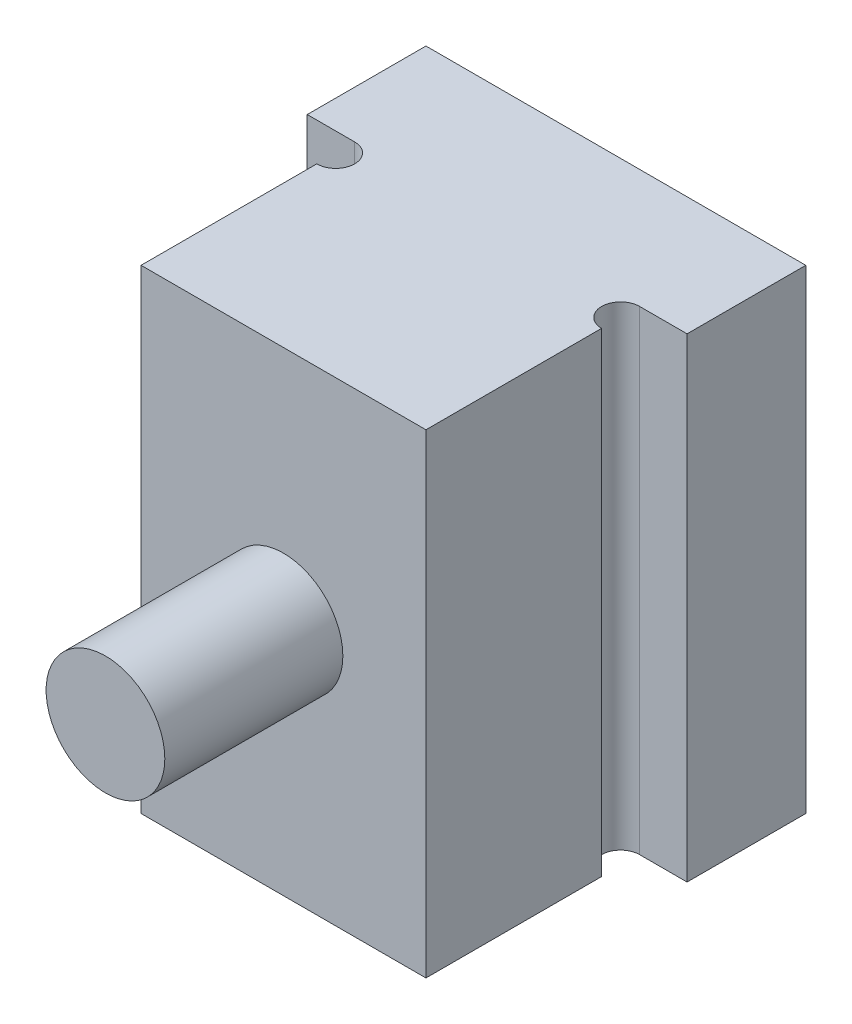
ISO-10303-21;
HEADER;
FILE_DESCRIPTION(('STEP AP214'),'2;1');
FILE_NAME('part.step','',(''),(''),'','','');
FILE_SCHEMA(('AUTOMOTIVE_DESIGN { 1 0 10303 214 1 1 1 1 }'));
ENDSEC;
DATA;
#1=APPLICATION_CONTEXT('core data for automotive mechanical design processes');
#2=APPLICATION_PROTOCOL_DEFINITION('international standard','automotive_design',2000,#1);
#3=PRODUCT_CONTEXT('',#1,'mechanical');
#4=PRODUCT('Part','Part','',(#3));
#5=PRODUCT_RELATED_PRODUCT_CATEGORY('part','',(#4));
#6=PRODUCT_DEFINITION_FORMATION('','',#4);
#7=PRODUCT_DEFINITION_CONTEXT('part definition',#1,'design');
#8=PRODUCT_DEFINITION('design','',#6,#7);
#9=PRODUCT_DEFINITION_SHAPE('','',#8);
#10=(LENGTH_UNIT() NAMED_UNIT(*) SI_UNIT(.MILLI.,.METRE.));
#11=(NAMED_UNIT(*) PLANE_ANGLE_UNIT() SI_UNIT($,.RADIAN.));
#12=(NAMED_UNIT(*) SI_UNIT($,.STERADIAN.) SOLID_ANGLE_UNIT());
#13=UNCERTAINTY_MEASURE_WITH_UNIT(LENGTH_MEASURE(1.E-05),#10,'distance_accuracy_value','');
#14=(GEOMETRIC_REPRESENTATION_CONTEXT(3) GLOBAL_UNCERTAINTY_ASSIGNED_CONTEXT((#13)) GLOBAL_UNIT_ASSIGNED_CONTEXT((#10,
#11,#12)) REPRESENTATION_CONTEXT('',''));
#15=CARTESIAN_POINT('',(0.,0.,0.));
#16=DIRECTION('',(0.,0.,1.));
#17=DIRECTION('',(1.,0.,0.));
#18=AXIS2_PLACEMENT_3D('',#15,#16,#17);
#19=CARTESIAN_POINT('',(-1.15470053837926,2.,-9.95));
#20=DIRECTION('',(0.,0.,1.));
#21=DIRECTION('',(-1.,0.,0.));
#22=AXIS2_PLACEMENT_3D('',#19,#20,#21);
#23=PLANE('',#22);
#24=DIRECTION('',(1.,0.,0.));
#25=VECTOR('',#24,1.);
#26=CARTESIAN_POINT('',(-1.15470053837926,2.,-9.95));
#27=LINE('',#26,#25);
#28=CARTESIAN_POINT('',(-1.15470053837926,2.,-9.95));
#29=VERTEX_POINT('',#28);
#30=CARTESIAN_POINT('',(1.15470053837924,2.,-9.95));
#31=VERTEX_POINT('',#30);
#32=EDGE_CURVE('E128',#29,#31,#27,.T.);
#33=ORIENTED_EDGE('',*,*,#32,.T.);
#34=DIRECTION('',(0.5,-0.866025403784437,0.));
#35=VECTOR('',#34,1.);
#36=CARTESIAN_POINT('',(1.15470053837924,2.,-9.95));
#37=LINE('',#36,#35);
#38=CARTESIAN_POINT('',(2.3094010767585,0.,-9.95));
#39=VERTEX_POINT('',#38);
#40=EDGE_CURVE('E133',#31,#39,#37,.T.);
#41=ORIENTED_EDGE('',*,*,#40,.T.);
#42=DIRECTION('',(0.5,0.866025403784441,0.));
#43=VECTOR('',#42,1.);
#44=CARTESIAN_POINT('',(1.15470053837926,-2.,-9.95));
#45=LINE('',#44,#43);
#46=CARTESIAN_POINT('',(1.15470053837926,-2.,-9.95));
#47=VERTEX_POINT('',#46);
#48=EDGE_CURVE('E184',#47,#39,#45,.T.);
#49=ORIENTED_EDGE('',*,*,#48,.F.);
#50=DIRECTION('',(1.,0.,0.));
#51=VECTOR('',#50,1.);
#52=CARTESIAN_POINT('',(-1.15470053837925,-2.,-9.95));
#53=LINE('',#52,#51);
#54=CARTESIAN_POINT('',(-1.15470053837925,-2.,-9.95));
#55=VERTEX_POINT('',#54);
#56=EDGE_CURVE('E149',#55,#47,#53,.T.);
#57=ORIENTED_EDGE('',*,*,#56,.F.);
#58=DIRECTION('',(-0.5,0.866025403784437,0.));
#59=VECTOR('',#58,1.);
#60=CARTESIAN_POINT('',(-1.15470053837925,-2.,-9.95));
#61=LINE('',#60,#59);
#62=CARTESIAN_POINT('',(-2.30940107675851,0.,-9.95));
#63=VERTEX_POINT('',#62);
#64=EDGE_CURVE('E144',#55,#63,#61,.T.);
#65=ORIENTED_EDGE('',*,*,#64,.T.);
#66=DIRECTION('',(-0.5,-0.866025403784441,0.));
#67=VECTOR('',#66,1.);
#68=CARTESIAN_POINT('',(-1.15470053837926,2.,-9.95));
#69=LINE('',#68,#67);
#70=EDGE_CURVE('E146',#29,#63,#69,.T.);
#71=ORIENTED_EDGE('',*,*,#70,.F.);
#72=EDGE_LOOP('',(#33,#41,#49,#57,#65,#71));
#73=FACE_BOUND('',#72,.T.);
#74=ADVANCED_FACE('F16',(#73),#23,.F.);
#75=CARTESIAN_POINT('',(-1.15470053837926,2.,-9.95));
#76=DIRECTION('',(0.866025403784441,-0.5,0.));
#77=DIRECTION('',(-0.5,-0.866025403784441,0.));
#78=AXIS2_PLACEMENT_3D('',#75,#76,#77);
#79=PLANE('',#78);
#80=ORIENTED_EDGE('',*,*,#70,.T.);
#81=DIRECTION('',(0.,0.,-1.));
#82=VECTOR('',#81,1.);
#83=CARTESIAN_POINT('',(-2.30940107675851,0.,-9.95));
#84=LINE('',#83,#82);
#85=CARTESIAN_POINT('',(-2.30940107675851,0.,-13.5));
#86=VERTEX_POINT('',#85);
#87=EDGE_CURVE('E155',#63,#86,#84,.T.);
#88=ORIENTED_EDGE('',*,*,#87,.T.);
#89=DIRECTION('',(0.5,0.866025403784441,0.));
#90=VECTOR('',#89,1.);
#91=CARTESIAN_POINT('',(-2.30940107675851,0.,-13.5));
#92=LINE('',#91,#90);
#93=CARTESIAN_POINT('',(-1.15470053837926,2.,-13.5));
#94=VERTEX_POINT('',#93);
#95=EDGE_CURVE('E200',#86,#94,#92,.T.);
#96=ORIENTED_EDGE('',*,*,#95,.T.);
#97=DIRECTION('',(0.,0.,-1.));
#98=VECTOR('',#97,1.);
#99=CARTESIAN_POINT('',(-1.15470053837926,2.,-9.95));
#100=LINE('',#99,#98);
#101=EDGE_CURVE('E152',#94,#29,#100,.F.);
#102=ORIENTED_EDGE('',*,*,#101,.T.);
#103=EDGE_LOOP('',(#80,#88,#96,#102));
#104=FACE_BOUND('',#103,.T.);
#105=ADVANCED_FACE('F163',(#104),#79,.T.);
#106=CARTESIAN_POINT('',(-1.15470053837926,2.,-9.95));
#107=DIRECTION('',(0.,1.,0.));
#108=DIRECTION('',(1.,0.,0.));
#109=AXIS2_PLACEMENT_3D('',#106,#107,#108);
#110=PLANE('',#109);
#111=DIRECTION('',(0.,0.,-1.));
#112=VECTOR('',#111,1.);
#113=CARTESIAN_POINT('',(1.15470053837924,2.,-9.95));
#114=LINE('',#113,#112);
#115=CARTESIAN_POINT('',(1.15470053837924,2.,-13.5));
#116=VERTEX_POINT('',#115);
#117=EDGE_CURVE('E190',#116,#31,#114,.F.);
#118=ORIENTED_EDGE('',*,*,#117,.T.);
#119=ORIENTED_EDGE('',*,*,#32,.F.);
#120=ORIENTED_EDGE('',*,*,#101,.F.);
#121=DIRECTION('',(-1.,0.,0.));
#122=VECTOR('',#121,1.);
#123=CARTESIAN_POINT('',(0.,2.,-13.5));
#124=LINE('',#123,#122);
#125=EDGE_CURVE('E161',#94,#116,#124,.F.);
#126=ORIENTED_EDGE('',*,*,#125,.T.);
#127=EDGE_LOOP('',(#118,#119,#120,#126));
#128=FACE_BOUND('',#127,.T.);
#129=ADVANCED_FACE('F342',(#128),#110,.F.);
#130=CARTESIAN_POINT('',(1.15470053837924,2.,-9.95));
#131=DIRECTION('',(0.866025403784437,0.5,0.));
#132=DIRECTION('',(0.5,-0.866025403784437,0.));
#133=AXIS2_PLACEMENT_3D('',#130,#131,#132);
#134=PLANE('',#133);
#135=DIRECTION('',(0.,0.,-1.));
#136=VECTOR('',#135,1.);
#137=CARTESIAN_POINT('',(2.3094010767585,0.,-9.95));
#138=LINE('',#137,#136);
#139=CARTESIAN_POINT('',(2.3094010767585,0.,-13.5));
#140=VERTEX_POINT('',#139);
#141=EDGE_CURVE('E180',#39,#140,#138,.T.);
#142=ORIENTED_EDGE('',*,*,#141,.F.);
#143=ORIENTED_EDGE('',*,*,#40,.F.);
#144=ORIENTED_EDGE('',*,*,#117,.F.);
#145=DIRECTION('',(0.5,-0.866025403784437,0.));
#146=VECTOR('',#145,1.);
#147=CARTESIAN_POINT('',(1.15470053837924,2.,-13.5));
#148=LINE('',#147,#146);
#149=EDGE_CURVE('E600',#116,#140,#148,.T.);
#150=ORIENTED_EDGE('',*,*,#149,.T.);
#151=EDGE_LOOP('',(#142,#143,#144,#150));
#152=FACE_BOUND('',#151,.T.);
#153=ADVANCED_FACE('F528',(#152),#134,.F.);
#154=CARTESIAN_POINT('',(1.15470053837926,-2.,-9.95));
#155=DIRECTION('',(-0.866025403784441,0.5,0.));
#156=DIRECTION('',(0.5,0.866025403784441,0.));
#157=AXIS2_PLACEMENT_3D('',#154,#155,#156);
#158=PLANE('',#157);
#159=ORIENTED_EDGE('',*,*,#48,.T.);
#160=ORIENTED_EDGE('',*,*,#141,.T.);
#161=DIRECTION('',(-0.5,-0.866025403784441,0.));
#162=VECTOR('',#161,1.);
#163=CARTESIAN_POINT('',(2.3094010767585,0.,-13.5));
#164=LINE('',#163,#162);
#165=CARTESIAN_POINT('',(1.15470053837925,-2.,-13.5));
#166=VERTEX_POINT('',#165);
#167=EDGE_CURVE('E603',#140,#166,#164,.T.);
#168=ORIENTED_EDGE('',*,*,#167,.T.);
#169=DIRECTION('',(0.,0.,-1.));
#170=VECTOR('',#169,1.);
#171=CARTESIAN_POINT('',(1.15470053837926,-2.,-9.95));
#172=LINE('',#171,#170);
#173=EDGE_CURVE('E174',#47,#166,#172,.T.);
#174=ORIENTED_EDGE('',*,*,#173,.F.);
#175=EDGE_LOOP('',(#159,#160,#168,#174));
#176=FACE_BOUND('',#175,.T.);
#177=ADVANCED_FACE('F519',(#176),#158,.T.);
#178=CARTESIAN_POINT('',(-1.15470053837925,-2.,-9.95));
#179=DIRECTION('',(0.,1.,0.));
#180=DIRECTION('',(1.,0.,0.));
#181=AXIS2_PLACEMENT_3D('',#178,#179,#180);
#182=PLANE('',#181);
#183=ORIENTED_EDGE('',*,*,#56,.T.);
#184=ORIENTED_EDGE('',*,*,#173,.T.);
#185=DIRECTION('',(-1.,0.,0.));
#186=VECTOR('',#185,1.);
#187=CARTESIAN_POINT('',(0.,-2.,-13.5));
#188=LINE('',#187,#186);
#189=CARTESIAN_POINT('',(-1.15470053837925,-2.,-13.5));
#190=VERTEX_POINT('',#189);
#191=EDGE_CURVE('E605',#166,#190,#188,.T.);
#192=ORIENTED_EDGE('',*,*,#191,.T.);
#193=DIRECTION('',(0.,0.,-1.));
#194=VECTOR('',#193,1.);
#195=CARTESIAN_POINT('',(-1.15470053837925,-2.,-9.95));
#196=LINE('',#195,#194);
#197=EDGE_CURVE('E153',#190,#55,#196,.F.);
#198=ORIENTED_EDGE('',*,*,#197,.T.);
#199=EDGE_LOOP('',(#183,#184,#192,#198));
#200=FACE_BOUND('',#199,.T.);
#201=ADVANCED_FACE('F511',(#200),#182,.T.);
#202=CARTESIAN_POINT('',(-1.15470053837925,-2.,-9.95));
#203=DIRECTION('',(-0.866025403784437,-0.5,0.));
#204=DIRECTION('',(-0.5,0.866025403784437,0.));
#205=AXIS2_PLACEMENT_3D('',#202,#203,#204);
#206=PLANE('',#205);
#207=ORIENTED_EDGE('',*,*,#87,.F.);
#208=ORIENTED_EDGE('',*,*,#64,.F.);
#209=ORIENTED_EDGE('',*,*,#197,.F.);
#210=DIRECTION('',(-0.5,0.866025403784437,0.));
#211=VECTOR('',#210,1.);
#212=CARTESIAN_POINT('',(-1.15470053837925,-2.,-13.5));
#213=LINE('',#212,#211);
#214=EDGE_CURVE('E36',#190,#86,#213,.T.);
#215=ORIENTED_EDGE('',*,*,#214,.T.);
#216=EDGE_LOOP('',(#207,#208,#209,#215));
#217=FACE_BOUND('',#216,.T.);
#218=ADVANCED_FACE('F156',(#217),#206,.F.);
#219=CARTESIAN_POINT('',(0.,-4.05,-13.5));
#220=DIRECTION('',(0.,0.,1.));
#221=DIRECTION('',(-1.,0.,0.));
#222=AXIS2_PLACEMENT_3D('',#219,#220,#221);
#223=PLANE('',#222);
#224=CARTESIAN_POINT('',(0.,0.,-13.5));
#225=DIRECTION('',(0.,0.,1.));
#226=DIRECTION('',(-1.,0.,0.));
#227=AXIS2_PLACEMENT_3D('',#224,#225,#226);
#228=CIRCLE('',#227,4.25);
#229=CARTESIAN_POINT('',(-4.25,0.,-13.5));
#230=VERTEX_POINT('',#229);
#231=EDGE_CURVE('E199',#230,#230,#228,.T.);
#232=ORIENTED_EDGE('',*,*,#231,.F.);
#233=EDGE_LOOP('',(#232));
#234=FACE_BOUND('',#233,.T.);
#235=ORIENTED_EDGE('',*,*,#214,.F.);
#236=ORIENTED_EDGE('',*,*,#191,.F.);
#237=ORIENTED_EDGE('',*,*,#167,.F.);
#238=ORIENTED_EDGE('',*,*,#149,.F.);
#239=ORIENTED_EDGE('',*,*,#125,.F.);
#240=ORIENTED_EDGE('',*,*,#95,.F.);
#241=EDGE_LOOP('',(#235,#236,#237,#238,#239,#240));
#242=FACE_BOUND('',#241,.T.);
#243=ADVANCED_FACE('F347',(#234,#242),#223,.F.);
#244=CARTESIAN_POINT('',(0.,0.,-8.5));
#245=DIRECTION('',(0.,0.,-1.));
#246=DIRECTION('',(1.,0.,0.));
#247=AXIS2_PLACEMENT_3D('',#244,#245,#246);
#248=CYLINDRICAL_SURFACE('',#247,4.25);
#249=CARTESIAN_POINT('',(0.,0.,-8.5));
#250=DIRECTION('',(0.,0.,-1.));
#251=DIRECTION('',(1.,0.,0.));
#252=AXIS2_PLACEMENT_3D('',#249,#250,#251);
#253=CIRCLE('',#252,4.25);
#254=CARTESIAN_POINT('',(4.25,0.,-8.5));
#255=VERTEX_POINT('',#254);
#256=EDGE_CURVE('E195',#255,#255,#253,.T.);
#257=ORIENTED_EDGE('',*,*,#256,.T.);
#258=EDGE_LOOP('',(#257));
#259=FACE_BOUND('',#258,.T.);
#260=ORIENTED_EDGE('',*,*,#231,.T.);
#261=EDGE_LOOP('',(#260));
#262=FACE_BOUND('',#261,.T.);
#263=ADVANCED_FACE('F350',(#259,#262),#248,.T.);
#264=CARTESIAN_POINT('',(-6.,9.99999999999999,-8.2));
#265=DIRECTION('',(0.,-1.,0.));
#266=DIRECTION('',(-1.,0.,0.));
#267=AXIS2_PLACEMENT_3D('',#264,#265,#266);
#268=CYLINDRICAL_SURFACE('',#267,0.8);
#269=CARTESIAN_POINT('',(-6.,9.99999999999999,-8.2));
#270=DIRECTION('',(0.,-1.,0.));
#271=DIRECTION('',(-1.,0.,0.));
#272=AXIS2_PLACEMENT_3D('',#269,#270,#271);
#273=CIRCLE('',#272,0.8);
#274=CARTESIAN_POINT('',(-6.,9.99999999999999,-9.));
#275=VERTEX_POINT('',#274);
#276=CARTESIAN_POINT('',(-6.,9.99999999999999,-7.4));
#277=VERTEX_POINT('',#276);
#278=EDGE_CURVE('E275',#275,#277,#273,.T.);
#279=ORIENTED_EDGE('',*,*,#278,.F.);
#280=DIRECTION('',(0.,-1.,0.));
#281=VECTOR('',#280,1.);
#282=CARTESIAN_POINT('',(-6.,9.99999999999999,-9.));
#283=LINE('',#282,#281);
#284=CARTESIAN_POINT('',(-6.,-9.99999999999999,-9.));
#285=VERTEX_POINT('',#284);
#286=EDGE_CURVE('E213',#275,#285,#283,.T.);
#287=ORIENTED_EDGE('',*,*,#286,.T.);
#288=CARTESIAN_POINT('',(-6.,-9.99999999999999,-8.2));
#289=DIRECTION('',(0.,-1.,0.));
#290=DIRECTION('',(-1.,0.,0.));
#291=AXIS2_PLACEMENT_3D('',#288,#289,#290);
#292=CIRCLE('',#291,0.8);
#293=CARTESIAN_POINT('',(-6.,-9.99999999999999,-7.4));
#294=VERTEX_POINT('',#293);
#295=EDGE_CURVE('E279',#294,#285,#292,.F.);
#296=ORIENTED_EDGE('',*,*,#295,.F.);
#297=DIRECTION('',(0.,-1.,0.));
#298=VECTOR('',#297,1.);
#299=CARTESIAN_POINT('',(-6.,-9.99999999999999,-7.4));
#300=LINE('',#299,#298);
#301=EDGE_CURVE('E236',#294,#277,#300,.F.);
#302=ORIENTED_EDGE('',*,*,#301,.T.);
#303=EDGE_LOOP('',(#279,#287,#296,#302));
#304=FACE_BOUND('',#303,.T.);
#305=ADVANCED_FACE('F354',(#304),#268,.F.);
#306=CARTESIAN_POINT('',(-12.,9.99999999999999,-9.));
#307=DIRECTION('',(0.,0.,-1.));
#308=DIRECTION('',(1.,0.,0.));
#309=AXIS2_PLACEMENT_3D('',#306,#307,#308);
#310=PLANE('',#309);
#311=DIRECTION('',(0.,-1.,0.));
#312=VECTOR('',#311,1.);
#313=CARTESIAN_POINT('',(-8.,-9.99999999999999,-9.));
#314=LINE('',#313,#312);
#315=CARTESIAN_POINT('',(-8.,9.99999999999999,-9.));
#316=VERTEX_POINT('',#315);
#317=CARTESIAN_POINT('',(-8.,-9.99999999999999,-9.));
#318=VERTEX_POINT('',#317);
#319=EDGE_CURVE('E211',#316,#318,#314,.T.);
#320=ORIENTED_EDGE('',*,*,#319,.T.);
#321=DIRECTION('',(1.,0.,0.));
#322=VECTOR('',#321,1.);
#323=CARTESIAN_POINT('',(-12.,-9.99999999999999,-9.));
#324=LINE('',#323,#322);
#325=EDGE_CURVE('E217',#285,#318,#324,.F.);
#326=ORIENTED_EDGE('',*,*,#325,.F.);
#327=ORIENTED_EDGE('',*,*,#286,.F.);
#328=DIRECTION('',(1.,0.,0.));
#329=VECTOR('',#328,1.);
#330=CARTESIAN_POINT('',(6.,9.99999999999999,-9.));
#331=LINE('',#330,#329);
#332=EDGE_CURVE('E207',#316,#275,#331,.T.);
#333=ORIENTED_EDGE('',*,*,#332,.F.);
#334=EDGE_LOOP('',(#320,#326,#327,#333));
#335=FACE_BOUND('',#334,.T.);
#336=ADVANCED_FACE('F365',(#335),#310,.F.);
#337=CARTESIAN_POINT('',(-8.,-9.99999999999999,-14.));
#338=DIRECTION('',(1.,0.,0.));
#339=DIRECTION('',(0.,-1.,0.));
#340=AXIS2_PLACEMENT_3D('',#337,#338,#339);
#341=PLANE('',#340);
#342=DIRECTION('',(0.,1.,0.));
#343=VECTOR('',#342,1.);
#344=CARTESIAN_POINT('',(-8.,-9.99999999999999,-14.));
#345=LINE('',#344,#343);
#346=CARTESIAN_POINT('',(-8.,-9.99999999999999,-14.));
#347=VERTEX_POINT('',#346);
#348=CARTESIAN_POINT('',(-8.,9.99999999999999,-14.));
#349=VERTEX_POINT('',#348);
#350=EDGE_CURVE('E302',#347,#349,#345,.T.);
#351=ORIENTED_EDGE('',*,*,#350,.F.);
#352=DIRECTION('',(0.,0.,1.));
#353=VECTOR('',#352,1.);
#354=CARTESIAN_POINT('',(-8.,-9.99999999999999,-14.));
#355=LINE('',#354,#353);
#356=EDGE_CURVE('E242',#318,#347,#355,.F.);
#357=ORIENTED_EDGE('',*,*,#356,.F.);
#358=ORIENTED_EDGE('',*,*,#319,.F.);
#359=DIRECTION('',(0.,0.,-1.));
#360=VECTOR('',#359,1.);
#361=CARTESIAN_POINT('',(-8.,9.99999999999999,-14.));
#362=LINE('',#361,#360);
#363=EDGE_CURVE('E259',#316,#349,#362,.T.);
#364=ORIENTED_EDGE('',*,*,#363,.T.);
#365=EDGE_LOOP('',(#351,#357,#358,#364));
#366=FACE_BOUND('',#365,.T.);
#367=ADVANCED_FACE('F333',(#366),#341,.F.);
#368=CARTESIAN_POINT('',(8.,-9.99999999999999,-14.));
#369=DIRECTION('',(0.,0.,1.));
#370=DIRECTION('',(-1.,0.,0.));
#371=AXIS2_PLACEMENT_3D('',#368,#369,#370);
#372=PLANE('',#371);
#373=DIRECTION('',(-1.,0.,0.));
#374=VECTOR('',#373,1.);
#375=CARTESIAN_POINT('',(8.,-9.99999999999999,-14.));
#376=LINE('',#375,#374);
#377=CARTESIAN_POINT('',(8.,-9.99999999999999,-14.));
#378=VERTEX_POINT('',#377);
#379=EDGE_CURVE('E298',#378,#347,#376,.T.);
#380=ORIENTED_EDGE('',*,*,#379,.T.);
#381=ORIENTED_EDGE('',*,*,#350,.T.);
#382=DIRECTION('',(-1.,0.,0.));
#383=VECTOR('',#382,1.);
#384=CARTESIAN_POINT('',(8.,9.99999999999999,-14.));
#385=LINE('',#384,#383);
#386=CARTESIAN_POINT('',(8.,9.99999999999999,-14.));
#387=VERTEX_POINT('',#386);
#388=EDGE_CURVE('E267',#387,#349,#385,.T.);
#389=ORIENTED_EDGE('',*,*,#388,.F.);
#390=DIRECTION('',(0.,-1.,0.));
#391=VECTOR('',#390,1.);
#392=CARTESIAN_POINT('',(8.,-9.99999999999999,-14.));
#393=LINE('',#392,#391);
#394=EDGE_CURVE('E294',#387,#378,#393,.T.);
#395=ORIENTED_EDGE('',*,*,#394,.T.);
#396=EDGE_LOOP('',(#380,#381,#389,#395));
#397=FACE_BOUND('',#396,.T.);
#398=CARTESIAN_POINT('',(0.,0.,-14.));
#399=DIRECTION('',(0.,0.,1.));
#400=DIRECTION('',(-1.,0.,0.));
#401=AXIS2_PLACEMENT_3D('',#398,#399,#400);
#402=CIRCLE('',#401,5.);
#403=CARTESIAN_POINT('',(-5.,0.,-14.));
#404=VERTEX_POINT('',#403);
#405=EDGE_CURVE('E20',#404,#404,#402,.T.);
#406=ORIENTED_EDGE('',*,*,#405,.T.);
#407=EDGE_LOOP('',(#406));
#408=FACE_BOUND('',#407,.T.);
#409=ADVANCED_FACE('F320',(#397,#408),#372,.F.);
#410=CARTESIAN_POINT('',(0.,0.,-14.));
#411=DIRECTION('',(0.,0.,-1.));
#412=DIRECTION('',(1.,0.,0.));
#413=AXIS2_PLACEMENT_3D('',#410,#411,#412);
#414=CYLINDRICAL_SURFACE('',#413,5.);
#415=CARTESIAN_POINT('',(0.,0.,-8.5));
#416=DIRECTION('',(0.,0.,-1.));
#417=DIRECTION('',(1.,0.,0.));
#418=AXIS2_PLACEMENT_3D('',#415,#416,#417);
#419=CIRCLE('',#418,5.);
#420=CARTESIAN_POINT('',(5.,0.,-8.5));
#421=VERTEX_POINT('',#420);
#422=EDGE_CURVE('E225',#421,#421,#419,.T.);
#423=ORIENTED_EDGE('',*,*,#422,.F.);
#424=EDGE_LOOP('',(#423));
#425=FACE_BOUND('',#424,.T.);
#426=ORIENTED_EDGE('',*,*,#405,.F.);
#427=EDGE_LOOP('',(#426));
#428=FACE_BOUND('',#427,.T.);
#429=ADVANCED_FACE('F18',(#425,#428),#414,.F.);
#430=CARTESIAN_POINT('',(0.,-5.,-8.5));
#431=DIRECTION('',(0.,0.,1.));
#432=DIRECTION('',(-1.,0.,0.));
#433=AXIS2_PLACEMENT_3D('',#430,#431,#432);
#434=PLANE('',#433);
#435=ORIENTED_EDGE('',*,*,#256,.F.);
#436=EDGE_LOOP('',(#435));
#437=FACE_BOUND('',#436,.T.);
#438=ORIENTED_EDGE('',*,*,#422,.T.);
#439=EDGE_LOOP('',(#438));
#440=FACE_BOUND('',#439,.T.);
#441=ADVANCED_FACE('F323',(#437,#440),#434,.F.);
#442=CARTESIAN_POINT('',(8.,-9.99999999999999,-14.));
#443=DIRECTION('',(-1.,0.,0.));
#444=DIRECTION('',(0.,1.,0.));
#445=AXIS2_PLACEMENT_3D('',#442,#443,#444);
#446=PLANE('',#445);
#447=ORIENTED_EDGE('',*,*,#394,.F.);
#448=DIRECTION('',(0.,0.,-1.));
#449=VECTOR('',#448,1.);
#450=CARTESIAN_POINT('',(8.,9.99999999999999,-14.));
#451=LINE('',#450,#449);
#452=CARTESIAN_POINT('',(8.,9.99999999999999,-9.));
#453=VERTEX_POINT('',#452);
#454=EDGE_CURVE('E249',#453,#387,#451,.T.);
#455=ORIENTED_EDGE('',*,*,#454,.F.);
#456=DIRECTION('',(0.,1.,0.));
#457=VECTOR('',#456,1.);
#458=CARTESIAN_POINT('',(8.,-9.99999999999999,-9.));
#459=LINE('',#458,#457);
#460=CARTESIAN_POINT('',(8.,-9.99999999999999,-9.));
#461=VERTEX_POINT('',#460);
#462=EDGE_CURVE('E212',#461,#453,#459,.T.);
#463=ORIENTED_EDGE('',*,*,#462,.F.);
#464=DIRECTION('',(0.,0.,1.));
#465=VECTOR('',#464,1.);
#466=CARTESIAN_POINT('',(8.,-9.99999999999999,-14.));
#467=LINE('',#466,#465);
#468=EDGE_CURVE('E263',#461,#378,#467,.F.);
#469=ORIENTED_EDGE('',*,*,#468,.T.);
#470=EDGE_LOOP('',(#447,#455,#463,#469));
#471=FACE_BOUND('',#470,.T.);
#472=ADVANCED_FACE('F330',(#471),#446,.F.);
#473=CARTESIAN_POINT('',(6.,9.99999999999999,-9.));
#474=DIRECTION('',(0.,0.,-1.));
#475=DIRECTION('',(1.,0.,0.));
#476=AXIS2_PLACEMENT_3D('',#473,#474,#475);
#477=PLANE('',#476);
#478=DIRECTION('',(1.,0.,0.));
#479=VECTOR('',#478,1.);
#480=CARTESIAN_POINT('',(6.,9.99999999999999,-9.));
#481=LINE('',#480,#479);
#482=CARTESIAN_POINT('',(6.,9.99999999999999,-9.));
#483=VERTEX_POINT('',#482);
#484=EDGE_CURVE('E218',#483,#453,#481,.T.);
#485=ORIENTED_EDGE('',*,*,#484,.F.);
#486=DIRECTION('',(0.,-1.,0.));
#487=VECTOR('',#486,1.);
#488=CARTESIAN_POINT('',(6.,9.99999999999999,-9.));
#489=LINE('',#488,#487);
#490=CARTESIAN_POINT('',(6.,-9.99999999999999,-9.));
#491=VERTEX_POINT('',#490);
#492=EDGE_CURVE('E226',#491,#483,#489,.F.);
#493=ORIENTED_EDGE('',*,*,#492,.F.);
#494=DIRECTION('',(1.,0.,0.));
#495=VECTOR('',#494,1.);
#496=CARTESIAN_POINT('',(6.,-9.99999999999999,-9.));
#497=LINE('',#496,#495);
#498=EDGE_CURVE('E230',#461,#491,#497,.F.);
#499=ORIENTED_EDGE('',*,*,#498,.F.);
#500=ORIENTED_EDGE('',*,*,#462,.T.);
#501=EDGE_LOOP('',(#485,#493,#499,#500));
#502=FACE_BOUND('',#501,.T.);
#503=ADVANCED_FACE('F369',(#502),#477,.F.);
#504=CARTESIAN_POINT('',(6.,9.99999999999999,-8.2));
#505=DIRECTION('',(0.,-1.,0.));
#506=DIRECTION('',(-1.,0.,0.));
#507=AXIS2_PLACEMENT_3D('',#504,#505,#506);
#508=CYLINDRICAL_SURFACE('',#507,0.8);
#509=CARTESIAN_POINT('',(6.,9.99999999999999,-8.2));
#510=DIRECTION('',(0.,-1.,0.));
#511=DIRECTION('',(-1.,0.,0.));
#512=AXIS2_PLACEMENT_3D('',#509,#510,#511);
#513=CIRCLE('',#512,0.8);
#514=CARTESIAN_POINT('',(6.,9.99999999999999,-7.4));
#515=VERTEX_POINT('',#514);
#516=EDGE_CURVE('E283',#515,#483,#513,.T.);
#517=ORIENTED_EDGE('',*,*,#516,.F.);
#518=DIRECTION('',(0.,1.,0.));
#519=VECTOR('',#518,1.);
#520=CARTESIAN_POINT('',(6.,-9.99999999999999,-7.4));
#521=LINE('',#520,#519);
#522=CARTESIAN_POINT('',(6.,-9.99999999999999,-7.4));
#523=VERTEX_POINT('',#522);
#524=EDGE_CURVE('E274',#515,#523,#521,.F.);
#525=ORIENTED_EDGE('',*,*,#524,.T.);
#526=CARTESIAN_POINT('',(6.,-9.99999999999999,-8.2));
#527=DIRECTION('',(0.,-1.,0.));
#528=DIRECTION('',(-1.,0.,0.));
#529=AXIS2_PLACEMENT_3D('',#526,#527,#528);
#530=CIRCLE('',#529,0.8);
#531=EDGE_CURVE('E286',#491,#523,#530,.F.);
#532=ORIENTED_EDGE('',*,*,#531,.F.);
#533=ORIENTED_EDGE('',*,*,#492,.T.);
#534=EDGE_LOOP('',(#517,#525,#532,#533));
#535=FACE_BOUND('',#534,.T.);
#536=ADVANCED_FACE('F371',(#535),#508,.F.);
#537=CARTESIAN_POINT('',(6.,-9.99999999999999,0.));
#538=DIRECTION('',(-1.,0.,0.));
#539=DIRECTION('',(0.,1.,0.));
#540=AXIS2_PLACEMENT_3D('',#537,#538,#539);
#541=PLANE('',#540);
#542=DIRECTION('',(0.,1.,0.));
#543=VECTOR('',#542,1.);
#544=CARTESIAN_POINT('',(6.,-9.99999999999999,0.));
#545=LINE('',#544,#543);
#546=CARTESIAN_POINT('',(6.,-9.99999999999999,0.));
#547=VERTEX_POINT('',#546);
#548=CARTESIAN_POINT('',(6.,9.99999999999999,0.));
#549=VERTEX_POINT('',#548);
#550=EDGE_CURVE('E115',#547,#549,#545,.T.);
#551=ORIENTED_EDGE('',*,*,#550,.F.);
#552=DIRECTION('',(0.,0.,1.));
#553=VECTOR('',#552,1.);
#554=CARTESIAN_POINT('',(6.,-9.99999999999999,-14.));
#555=LINE('',#554,#553);
#556=EDGE_CURVE('E222',#547,#523,#555,.F.);
#557=ORIENTED_EDGE('',*,*,#556,.T.);
#558=ORIENTED_EDGE('',*,*,#524,.F.);
#559=DIRECTION('',(0.,0.,-1.));
#560=VECTOR('',#559,1.);
#561=CARTESIAN_POINT('',(6.,9.99999999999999,0.));
#562=LINE('',#561,#560);
#563=EDGE_CURVE('E253',#549,#515,#562,.T.);
#564=ORIENTED_EDGE('',*,*,#563,.F.);
#565=EDGE_LOOP('',(#551,#557,#558,#564));
#566=FACE_BOUND('',#565,.T.);
#567=ADVANCED_FACE('F378',(#566),#541,.F.);
#568=CARTESIAN_POINT('',(6.,-9.99999999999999,-14.));
#569=DIRECTION('',(0.,1.,0.));
#570=DIRECTION('',(1.,0.,0.));
#571=AXIS2_PLACEMENT_3D('',#568,#569,#570);
#572=PLANE('',#571);
#573=DIRECTION('',(1.,0.,0.));
#574=VECTOR('',#573,1.);
#575=CARTESIAN_POINT('',(6.,-9.99999999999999,0.));
#576=LINE('',#575,#574);
#577=CARTESIAN_POINT('',(-6.,-9.99999999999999,0.));
#578=VERTEX_POINT('',#577);
#579=EDGE_CURVE('E309',#578,#547,#576,.T.);
#580=ORIENTED_EDGE('',*,*,#579,.F.);
#581=DIRECTION('',(0.,0.,1.));
#582=VECTOR('',#581,1.);
#583=CARTESIAN_POINT('',(-6.,-9.99999999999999,0.));
#584=LINE('',#583,#582);
#585=EDGE_CURVE('E246',#578,#294,#584,.F.);
#586=ORIENTED_EDGE('',*,*,#585,.T.);
#587=ORIENTED_EDGE('',*,*,#295,.T.);
#588=ORIENTED_EDGE('',*,*,#325,.T.);
#589=ORIENTED_EDGE('',*,*,#356,.T.);
#590=ORIENTED_EDGE('',*,*,#379,.F.);
#591=ORIENTED_EDGE('',*,*,#468,.F.);
#592=ORIENTED_EDGE('',*,*,#498,.T.);
#593=ORIENTED_EDGE('',*,*,#531,.T.);
#594=ORIENTED_EDGE('',*,*,#556,.F.);
#595=EDGE_LOOP('',(#580,#586,#587,#588,#589,#590,#591,#592,#593,#594));
#596=FACE_BOUND('',#595,.T.);
#597=ADVANCED_FACE('F396',(#596),#572,.F.);
#598=CARTESIAN_POINT('',(-6.,-9.99999999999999,0.));
#599=DIRECTION('',(1.,0.,0.));
#600=DIRECTION('',(0.,0.,1.));
#601=AXIS2_PLACEMENT_3D('',#598,#599,#600);
#602=PLANE('',#601);
#603=DIRECTION('',(0.,-1.,0.));
#604=VECTOR('',#603,1.);
#605=CARTESIAN_POINT('',(-6.,-9.99999999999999,0.));
#606=LINE('',#605,#604);
#607=CARTESIAN_POINT('',(-6.,9.99999999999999,0.));
#608=VERTEX_POINT('',#607);
#609=EDGE_CURVE('E306',#608,#578,#606,.T.);
#610=ORIENTED_EDGE('',*,*,#609,.F.);
#611=DIRECTION('',(0.,0.,-1.));
#612=VECTOR('',#611,1.);
#613=CARTESIAN_POINT('',(-6.,9.99999999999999,-14.));
#614=LINE('',#613,#612);
#615=EDGE_CURVE('E256',#608,#277,#614,.T.);
#616=ORIENTED_EDGE('',*,*,#615,.T.);
#617=ORIENTED_EDGE('',*,*,#301,.F.);
#618=ORIENTED_EDGE('',*,*,#585,.F.);
#619=EDGE_LOOP('',(#610,#616,#617,#618));
#620=FACE_BOUND('',#619,.T.);
#621=ADVANCED_FACE('F393',(#620),#602,.F.);
#622=CARTESIAN_POINT('',(6.,9.99999999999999,-14.));
#623=DIRECTION('',(0.,1.,0.));
#624=DIRECTION('',(1.,0.,0.));
#625=AXIS2_PLACEMENT_3D('',#622,#623,#624);
#626=PLANE('',#625);
#627=ORIENTED_EDGE('',*,*,#615,.F.);
#628=DIRECTION('',(1.,0.,0.));
#629=VECTOR('',#628,1.);
#630=CARTESIAN_POINT('',(6.,9.99999999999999,0.));
#631=LINE('',#630,#629);
#632=EDGE_CURVE('E121',#608,#549,#631,.T.);
#633=ORIENTED_EDGE('',*,*,#632,.T.);
#634=ORIENTED_EDGE('',*,*,#563,.T.);
#635=ORIENTED_EDGE('',*,*,#516,.T.);
#636=ORIENTED_EDGE('',*,*,#484,.T.);
#637=ORIENTED_EDGE('',*,*,#454,.T.);
#638=ORIENTED_EDGE('',*,*,#388,.T.);
#639=ORIENTED_EDGE('',*,*,#363,.F.);
#640=ORIENTED_EDGE('',*,*,#332,.T.);
#641=ORIENTED_EDGE('',*,*,#278,.T.);
#642=EDGE_LOOP('',(#627,#633,#634,#635,#636,#637,#638,#639,#640,#641));
#643=FACE_BOUND('',#642,.T.);
#644=ADVANCED_FACE('F389',(#643),#626,.T.);
#645=CARTESIAN_POINT('',(6.,-9.99999999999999,0.));
#646=DIRECTION('',(0.,0.,-1.));
#647=DIRECTION('',(1.,0.,0.));
#648=AXIS2_PLACEMENT_3D('',#645,#646,#647);
#649=PLANE('',#648);
#650=CARTESIAN_POINT('',(0.,0.,0.));
#651=DIRECTION('',(0.,0.,-1.));
#652=DIRECTION('',(0.,-1.,0.));
#653=AXIS2_PLACEMENT_3D('',#650,#651,#652);
#654=CIRCLE('',#653,2.5);
#655=CARTESIAN_POINT('',(0.,-2.5,0.));
#656=VERTEX_POINT('',#655);
#657=EDGE_CURVE('E11',#656,#656,#654,.F.);
#658=ORIENTED_EDGE('',*,*,#657,.F.);
#659=EDGE_LOOP('',(#658));
#660=FACE_BOUND('',#659,.T.);
#661=ORIENTED_EDGE('',*,*,#632,.F.);
#662=ORIENTED_EDGE('',*,*,#609,.T.);
#663=ORIENTED_EDGE('',*,*,#579,.T.);
#664=ORIENTED_EDGE('',*,*,#550,.T.);
#665=EDGE_LOOP('',(#661,#662,#663,#664));
#666=FACE_BOUND('',#665,.T.);
#667=ADVANCED_FACE('F363',(#660,#666),#649,.F.);
#668=CARTESIAN_POINT('',(0.,0.,-8.5));
#669=DIRECTION('',(0.,0.,-1.));
#670=DIRECTION('',(1.,0.,0.));
#671=AXIS2_PLACEMENT_3D('',#668,#669,#670);
#672=CYLINDRICAL_SURFACE('',#671,2.5);
#673=CARTESIAN_POINT('',(0.,0.,7.5));
#674=DIRECTION('',(0.,0.,-1.));
#675=DIRECTION('',(1.,0.,0.));
#676=AXIS2_PLACEMENT_3D('',#673,#674,#675);
#677=CIRCLE('',#676,2.5);
#678=CARTESIAN_POINT('',(2.5,0.,7.5));
#679=VERTEX_POINT('',#678);
#680=EDGE_CURVE('E27',#679,#679,#677,.T.);
#681=ORIENTED_EDGE('',*,*,#680,.T.);
#682=EDGE_LOOP('',(#681));
#683=FACE_BOUND('',#682,.T.);
#684=ORIENTED_EDGE('',*,*,#657,.T.);
#685=EDGE_LOOP('',(#684));
#686=FACE_BOUND('',#685,.T.);
#687=ADVANCED_FACE('F359',(#683,#686),#672,.T.);
#688=CARTESIAN_POINT('',(0.,0.,7.5));
#689=DIRECTION('',(0.,0.,-1.));
#690=DIRECTION('',(1.,0.,0.));
#691=AXIS2_PLACEMENT_3D('',#688,#689,#690);
#692=PLANE('',#691);
#693=ORIENTED_EDGE('',*,*,#680,.F.);
#694=EDGE_LOOP('',(#693));
#695=FACE_BOUND('',#694,.T.);
#696=ADVANCED_FACE('F356',(#695),#692,.F.);
#697=CLOSED_SHELL('',(#74,#105,#129,#153,#177,#201,#218,#243,#263,#305,#336,#367,#409,#429,#441,
#472,#503,#536,#567,#597,#621,#644,#667,#687,#696));
#698=MANIFOLD_SOLID_BREP('B1',#697);
#699=ADVANCED_BREP_SHAPE_REPRESENTATION('',(#18,#698),#14);
#700=SHAPE_DEFINITION_REPRESENTATION(#9,#699);
ENDSEC;
END-ISO-10303-21;
